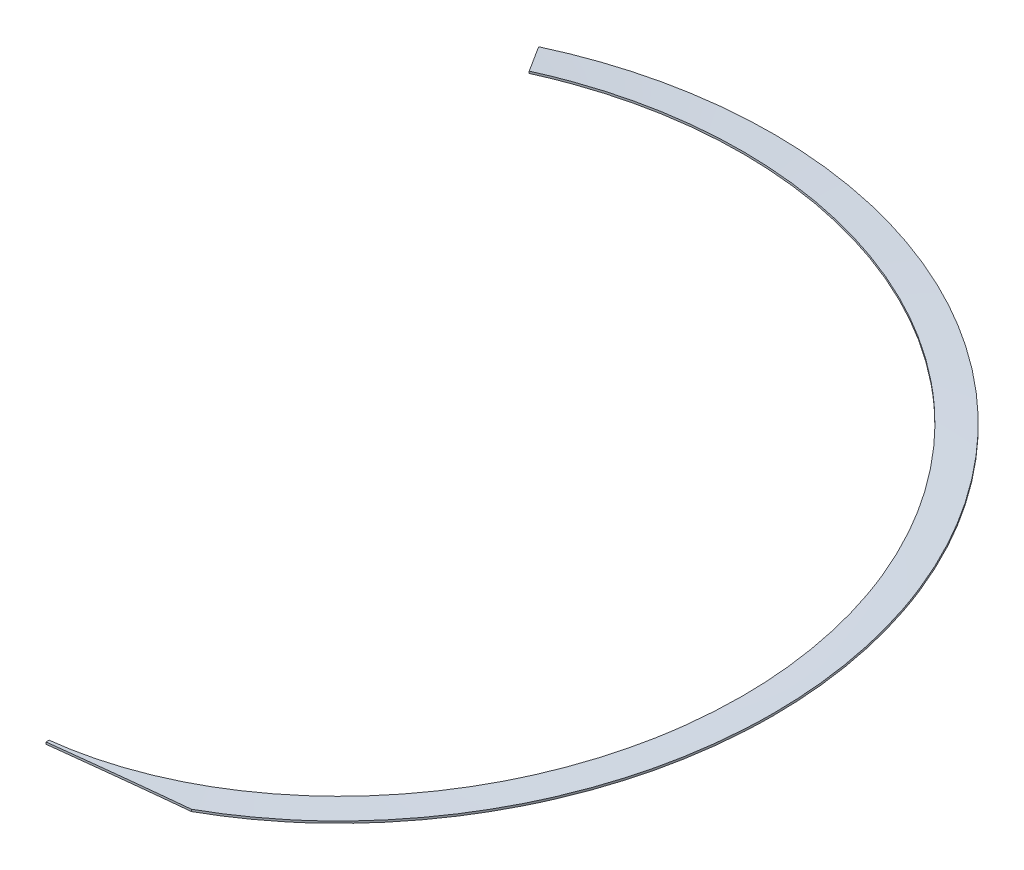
ISO-10303-21;
HEADER;
FILE_DESCRIPTION(('STEP AP214'),'2;1');
FILE_NAME('part.step','',(''),(''),'','','');
FILE_SCHEMA(('AUTOMOTIVE_DESIGN { 1 0 10303 214 1 1 1 1 }'));
ENDSEC;
DATA;
#1=APPLICATION_CONTEXT('core data for automotive mechanical design processes');
#2=APPLICATION_PROTOCOL_DEFINITION('international standard','automotive_design',2000,#1);
#3=PRODUCT_CONTEXT('',#1,'mechanical');
#4=PRODUCT('Part','Part','',(#3));
#5=PRODUCT_RELATED_PRODUCT_CATEGORY('part','',(#4));
#6=PRODUCT_DEFINITION_FORMATION('','',#4);
#7=PRODUCT_DEFINITION_CONTEXT('part definition',#1,'design');
#8=PRODUCT_DEFINITION('design','',#6,#7);
#9=PRODUCT_DEFINITION_SHAPE('','',#8);
#10=(LENGTH_UNIT() NAMED_UNIT(*) SI_UNIT(.MILLI.,.METRE.));
#11=(NAMED_UNIT(*) PLANE_ANGLE_UNIT() SI_UNIT($,.RADIAN.));
#12=(NAMED_UNIT(*) SI_UNIT($,.STERADIAN.) SOLID_ANGLE_UNIT());
#13=UNCERTAINTY_MEASURE_WITH_UNIT(LENGTH_MEASURE(1.E-05),#10,'distance_accuracy_value','');
#14=(GEOMETRIC_REPRESENTATION_CONTEXT(3) GLOBAL_UNCERTAINTY_ASSIGNED_CONTEXT((#13)) GLOBAL_UNIT_ASSIGNED_CONTEXT((#10,
#11,#12)) REPRESENTATION_CONTEXT('',''));
#15=CARTESIAN_POINT('',(0.,0.,0.));
#16=DIRECTION('',(0.,0.,1.));
#17=DIRECTION('',(1.,0.,0.));
#18=AXIS2_PLACEMENT_3D('',#15,#16,#17);
#19=CARTESIAN_POINT('',(0.,2.,390.));
#20=DIRECTION('',(-1.,0.,0.));
#21=DIRECTION('',(0.,0.,1.));
#22=AXIS2_PLACEMENT_3D('',#19,#20,#21);
#23=PLANE('',#22);
#24=DIRECTION('',(0.,0.,-1.));
#25=VECTOR('',#24,1.);
#26=CARTESIAN_POINT('',(0.,0.,390.));
#27=LINE('',#26,#25);
#28=CARTESIAN_POINT('',(0.,0.,363.));
#29=VERTEX_POINT('',#28);
#30=CARTESIAN_POINT('',(0.,0.,360.));
#31=VERTEX_POINT('',#30);
#32=EDGE_CURVE('E85',#29,#31,#27,.T.);
#33=ORIENTED_EDGE('',*,*,#32,.F.);
#34=DIRECTION('',(0.,-1.,0.));
#35=VECTOR('',#34,1.);
#36=CARTESIAN_POINT('',(0.,142.835564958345,363.));
#37=LINE('',#36,#35);
#38=CARTESIAN_POINT('',(0.,2.,363.));
#39=VERTEX_POINT('',#38);
#40=EDGE_CURVE('E49',#39,#29,#37,.T.);
#41=ORIENTED_EDGE('',*,*,#40,.F.);
#42=DIRECTION('',(0.,0.,1.));
#43=VECTOR('',#42,1.);
#44=CARTESIAN_POINT('',(0.,2.,390.));
#45=LINE('',#44,#43);
#46=CARTESIAN_POINT('',(0.,2.,360.));
#47=VERTEX_POINT('',#46);
#48=EDGE_CURVE('E78',#47,#39,#45,.T.);
#49=ORIENTED_EDGE('',*,*,#48,.F.);
#50=DIRECTION('',(0.,1.,0.));
#51=VECTOR('',#50,1.);
#52=CARTESIAN_POINT('',(0.,0.,360.));
#53=LINE('',#52,#51);
#54=EDGE_CURVE('E98',#31,#47,#53,.T.);
#55=ORIENTED_EDGE('',*,*,#54,.F.);
#56=EDGE_LOOP('',(#33,#41,#49,#55));
#57=FACE_BOUND('',#56,.T.);
#58=ADVANCED_FACE('F33',(#57),#23,.T.);
#59=CARTESIAN_POINT('',(0.,2.,360.));
#60=CARTESIAN_POINT('',(51.7601858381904,7.39291217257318,360.));
#61=CARTESIAN_POINT('',(101.423720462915,12.7858243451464,345.417470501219));
#62=CARTESIAN_POINT('',(151.087255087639,18.1787365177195,330.834941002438));
#63=CARTESIAN_POINT('',(194.630694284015,23.5716486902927,302.851271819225));
#64=CARTESIAN_POINT('',(238.174133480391,28.9645608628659,274.867602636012));
#65=CARTESIAN_POINT('',(272.069846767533,34.3574730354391,235.749864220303));
#66=CARTESIAN_POINT('',(305.965560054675,39.7503852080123,196.632125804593));
#67=CARTESIAN_POINT('',(327.467518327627,45.1432973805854,149.549404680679));
#68=CARTESIAN_POINT('',(348.969476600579,50.5362095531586,102.466683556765));
#69=CARTESIAN_POINT('',(356.335719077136,55.9291217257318,51.2333417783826));
#70=CARTESIAN_POINT('',(363.701961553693,61.322033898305,0.));
#71=CARTESIAN_POINT('',(356.335719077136,66.7149460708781,-51.2333417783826));
#72=CARTESIAN_POINT('',(348.969476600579,72.1078582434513,-102.466683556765));
#73=CARTESIAN_POINT('',(327.467518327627,77.5007704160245,-149.549404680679));
#74=CARTESIAN_POINT('',(305.965560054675,82.8936825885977,-196.632125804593));
#75=CARTESIAN_POINT('',(272.069846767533,88.2865947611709,-235.749864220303));
#76=CARTESIAN_POINT('',(238.174133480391,93.679506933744,-274.867602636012));
#77=CARTESIAN_POINT('',(194.630694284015,99.0724191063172,-302.851271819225));
#78=CARTESIAN_POINT('',(151.087255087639,104.46533127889,-330.834941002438));
#79=CARTESIAN_POINT('',(101.423720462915,109.858243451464,-345.417470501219));
#80=CARTESIAN_POINT('',(51.7601858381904,115.251155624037,-360.));
#81=CARTESIAN_POINT('',(0.,120.64406779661,-360.));
#82=CARTESIAN_POINT('',(-51.7601858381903,126.036979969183,-360.));
#83=CARTESIAN_POINT('',(-101.423720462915,131.429892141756,-345.417470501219));
#84=CARTESIAN_POINT('',(-151.087255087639,136.822804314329,-330.834941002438));
#85=CARTESIAN_POINT('',(-194.630694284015,142.215716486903,-302.851271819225));
#86=CARTESIAN_POINT('',(-238.174133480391,147.608628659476,-274.867602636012));
#87=CARTESIAN_POINT('',(-272.069846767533,153.001540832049,-235.749864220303));
#88=CARTESIAN_POINT('',(0.,2.,390.));
#89=CARTESIAN_POINT('',(56.0735346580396,7.39291217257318,390.));
#90=CARTESIAN_POINT('',(109.875697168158,12.7858243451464,374.202259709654));
#91=CARTESIAN_POINT('',(163.677859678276,18.1787365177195,358.404519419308));
#92=CARTESIAN_POINT('',(210.849918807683,23.5716486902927,328.088877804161));
#93=CARTESIAN_POINT('',(258.021977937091,28.9645608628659,297.773236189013));
#94=CARTESIAN_POINT('',(294.742333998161,34.3574730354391,255.395686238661));
#95=CARTESIAN_POINT('',(331.462690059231,39.7503852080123,213.018136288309));
#96=CARTESIAN_POINT('',(354.756478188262,45.1432973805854,162.011855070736));
#97=CARTESIAN_POINT('',(378.050266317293,50.5362095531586,111.005573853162));
#98=CARTESIAN_POINT('',(386.030362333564,55.9291217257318,55.5027869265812));
#99=CARTESIAN_POINT('',(394.010458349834,61.322033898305,0.));
#100=CARTESIAN_POINT('',(386.030362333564,66.7149460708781,-55.5027869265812));
#101=CARTESIAN_POINT('',(378.050266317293,72.1078582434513,-111.005573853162));
#102=CARTESIAN_POINT('',(354.756478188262,77.5007704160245,-162.011855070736));
#103=CARTESIAN_POINT('',(331.462690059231,82.8936825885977,-213.018136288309));
#104=CARTESIAN_POINT('',(294.742333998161,88.2865947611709,-255.395686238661));
#105=CARTESIAN_POINT('',(258.021977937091,93.679506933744,-297.773236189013));
#106=CARTESIAN_POINT('',(210.849918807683,99.0724191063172,-328.088877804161));
#107=CARTESIAN_POINT('',(163.677859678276,104.46533127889,-358.404519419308));
#108=CARTESIAN_POINT('',(109.875697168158,109.858243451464,-374.202259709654));
#109=CARTESIAN_POINT('',(56.0735346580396,115.251155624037,-390.));
#110=CARTESIAN_POINT('',(0.,120.64406779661,-390.));
#111=CARTESIAN_POINT('',(-56.0735346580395,126.036979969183,-390.));
#112=CARTESIAN_POINT('',(-109.875697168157,131.429892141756,-374.202259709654));
#113=CARTESIAN_POINT('',(-163.677859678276,136.822804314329,-358.404519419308));
#114=CARTESIAN_POINT('',(-210.849918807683,142.215716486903,-328.088877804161));
#115=CARTESIAN_POINT('',(-258.021977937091,147.608628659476,-297.773236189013));
#116=CARTESIAN_POINT('',(-294.742333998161,153.001540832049,-255.395686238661));
#117=(BOUNDED_SURFACE() B_SPLINE_SURFACE(1,2,((#59,#60,#61,#62,#63,#64,#65,#66,#67,#68,#69,#70,
#71,#72,#73,#74,#75,#76,#77,#78,#79,#80,#81,#82,#83,#84,#85,#86,#87),(#88,#89,#90,#91,#92,#93,
#94,#95,#96,#97,#98,#99,#100,#101,#102,#103,#104,#105,#106,#107,#108,#109,#110,#111,#112,#113,
#114,#115,#116)),.UNSPECIFIED.,.F.,.F.,.F.) B_SPLINE_SURFACE_WITH_KNOTS((2,2),(3,2,2,2,2,2,2,2,
2,2,2,2,2,2,3),(0.,1.),(0.,0.0714285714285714,0.142857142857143,0.214285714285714,
0.285714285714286,0.357142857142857,0.428571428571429,0.5,0.571428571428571,0.642857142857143,
0.714285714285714,0.785714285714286,0.857142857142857,0.928571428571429,1.),
.UNSPECIFIED.) GEOMETRIC_REPRESENTATION_ITEM() RATIONAL_B_SPLINE_SURFACE(((1.,0.989821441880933,
1.,0.989821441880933,1.,0.989821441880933,1.,0.989821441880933,1.,0.989821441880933,1.,
0.989821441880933,1.,0.989821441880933,1.,0.989821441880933,1.,0.989821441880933,1.,
0.989821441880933,1.,0.989821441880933,1.,0.989821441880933,1.,0.989821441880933,1.,
0.989821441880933,1.),(1.,0.989821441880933,1.,0.989821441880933,1.,0.989821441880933,1.,
0.989821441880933,1.,0.989821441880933,1.,0.989821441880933,1.,0.989821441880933,1.,
0.989821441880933,1.,0.989821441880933,1.,0.989821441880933,1.,0.989821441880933,1.,
0.989821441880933,1.,0.989821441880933,1.,0.989821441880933,1.))) REPRESENTATION_ITEM('') SURFACE());
#118=CARTESIAN_POINT('',(0.,2.,363.));
#119=CARTESIAN_POINT('',(3.34976168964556,2.34612837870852,363.));
#120=CARTESIAN_POINT('',(6.69945272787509,2.69293874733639,363.));
#121=CARTESIAN_POINT('',(13.3987780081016,3.38713223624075,363.));
#122=CARTESIAN_POINT('',(16.7484122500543,3.73451535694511,363.));
#123=CARTESIAN_POINT('',(23.4477044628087,4.42906270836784,363.));
#124=CARTESIAN_POINT('',(26.7973624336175,4.77622693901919,363.));
#125=CARTESIAN_POINT('',(33.4968065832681,5.46955608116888,363.));
#126=CARTESIAN_POINT('',(36.8465927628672,5.81572098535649,363.));
#127=CARTESIAN_POINT('',(43.5463464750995,6.50628311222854,363.));
#128=CARTESIAN_POINT('',(46.8963140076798,6.85068033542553,363.));
#129=CARTESIAN_POINT('',(53.5965057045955,7.53696665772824,363.));
#130=CARTESIAN_POINT('',(56.9467298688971,7.87885575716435,363.));
#131=CARTESIAN_POINT('',(63.7239997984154,8.567186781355,363.));
#132=CARTESIAN_POINT('',(67.1510531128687,8.91355443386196,363.));
#133=CARTESIAN_POINT('',(74.0055700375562,9.60220962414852,363.));
#134=CARTESIAN_POINT('',(77.4330336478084,9.94449716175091,363.));
#135=CARTESIAN_POINT('',(84.2884214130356,10.6243232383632,363.));
#136=CARTESIAN_POINT('',(87.7163455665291,10.9618617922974,363.));
#137=CARTESIAN_POINT('',(92.858623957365,11.4641524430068,363.));
#138=CARTESIAN_POINT('',(94.572782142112,11.6309131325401,363.));
#139=CARTESIAN_POINT('',(98.0012353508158,11.9630212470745,363.));
#140=CARTESIAN_POINT('',(99.7155303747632,12.1283686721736,363.));
#141=CARTESIAN_POINT('',(102.572839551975,12.4027294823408,363.));
#142=CARTESIAN_POINT('',(103.715814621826,12.5121499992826,363.));
#143=CARTESIAN_POINT('',(106.001831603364,12.7302906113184,363.));
#144=CARTESIAN_POINT('',(107.144873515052,12.8390107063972,363.));
#145=CARTESIAN_POINT('',(109.430995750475,13.056048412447,363.));
#146=CARTESIAN_POINT('',(110.574076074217,13.1643660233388,363.));
#147=CARTESIAN_POINT('',(112.860279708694,13.3805465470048,363.));
#148=CARTESIAN_POINT('',(114.003403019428,13.4884094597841,363.));
#149=CARTESIAN_POINT('',(117.432839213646,13.8112955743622,363.));
#150=CARTESIAN_POINT('',(119.719218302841,14.0256161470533,363.));
#151=CARTESIAN_POINT('',(124.292182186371,14.4522185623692,363.));
#152=CARTESIAN_POINT('',(126.578766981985,14.6645003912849,363.));
#153=CARTESIAN_POINT('',(131.152138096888,15.086875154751,363.));
#154=CARTESIAN_POINT('',(133.438924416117,15.2969680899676,363.));
#155=CARTESIAN_POINT('',(138.012708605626,15.7148284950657,363.));
#156=CARTESIAN_POINT('',(140.299706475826,15.9225959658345,363.));
#157=CARTESIAN_POINT('',(142.586815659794,16.1291324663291,363.));
#158=B_SPLINE_CURVE_WITH_KNOTS('',3,(#118,#119,#120,#121,#122,#123,#124,#125,#126,#127,#128,
#129,#130,#131,#132,#133,#134,#135,#136,#137,#138,#139,#140,#141,#142,#143,#144,#145,#146,#147,
#148,#149,#150,#151,#152,#153,#154,#155,#156,#157),.UNSPECIFIED.,.F.,.F.,(4,2,2,2,2,2,2,2,2,2,2,
2,2,2,2,2,2,2,2,4),(0.,10.1027901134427,20.2055877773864,30.3083885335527,40.411263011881,
50.5141345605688,60.6170047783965,70.9505396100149,81.2840748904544,91.6175776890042,
96.7843292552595,101.9510804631,105.395682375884,108.840284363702,112.284887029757,
115.729489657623,122.618695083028,129.507946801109,136.397196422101,143.286443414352),.UNSPECIFIED.);
#159=CARTESIAN_POINT('',(142.586815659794,16.1291324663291,363.));
#160=VERTEX_POINT('',#159);
#161=EDGE_CURVE('E93',#39,#160,#158,.T.);
#162=CARTESIAN_POINT('',(0.,2.,390.));
#163=CARTESIAN_POINT('',(56.0735346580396,7.39291217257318,390.));
#164=CARTESIAN_POINT('',(109.875697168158,12.7858243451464,374.202259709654));
#165=CARTESIAN_POINT('',(163.677859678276,18.1787365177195,358.404519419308));
#166=CARTESIAN_POINT('',(210.849918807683,23.5716486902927,328.088877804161));
#167=CARTESIAN_POINT('',(258.021977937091,28.9645608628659,297.773236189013));
#168=CARTESIAN_POINT('',(294.742333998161,34.3574730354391,255.395686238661));
#169=CARTESIAN_POINT('',(331.462690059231,39.7503852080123,213.018136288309));
#170=CARTESIAN_POINT('',(354.756478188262,45.1432973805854,162.011855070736));
#171=CARTESIAN_POINT('',(378.050266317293,50.5362095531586,111.005573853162));
#172=CARTESIAN_POINT('',(386.030362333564,55.9291217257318,55.5027869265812));
#173=CARTESIAN_POINT('',(394.010458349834,61.322033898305,0.));
#174=CARTESIAN_POINT('',(386.030362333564,66.7149460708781,-55.5027869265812));
#175=CARTESIAN_POINT('',(378.050266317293,72.1078582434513,-111.005573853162));
#176=CARTESIAN_POINT('',(354.756478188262,77.5007704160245,-162.011855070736));
#177=CARTESIAN_POINT('',(331.462690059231,82.8936825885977,-213.018136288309));
#178=CARTESIAN_POINT('',(294.742333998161,88.2865947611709,-255.395686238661));
#179=CARTESIAN_POINT('',(258.021977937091,93.679506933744,-297.773236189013));
#180=CARTESIAN_POINT('',(210.849918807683,99.0724191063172,-328.088877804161));
#181=CARTESIAN_POINT('',(163.677859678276,104.46533127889,-358.404519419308));
#182=CARTESIAN_POINT('',(109.875697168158,109.858243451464,-374.202259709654));
#183=CARTESIAN_POINT('',(56.0735346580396,115.251155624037,-390.));
#184=CARTESIAN_POINT('',(0.,120.64406779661,-390.));
#185=CARTESIAN_POINT('',(-56.0735346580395,126.036979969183,-390.));
#186=CARTESIAN_POINT('',(-109.875697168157,131.429892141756,-374.202259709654));
#187=CARTESIAN_POINT('',(-163.677859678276,136.822804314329,-358.404519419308));
#188=CARTESIAN_POINT('',(-210.849918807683,142.215716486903,-328.088877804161));
#189=CARTESIAN_POINT('',(-258.021977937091,147.608628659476,-297.773236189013));
#190=CARTESIAN_POINT('',(-294.742333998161,153.001540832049,-255.395686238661));
#191=(BOUNDED_CURVE() B_SPLINE_CURVE(2,(#162,#163,#164,#165,#166,#167,#168,#169,#170,#171,#172,
#173,#174,#175,#176,#177,#178,#179,#180,#181,#182,#183,#184,#185,#186,#187,#188,#189,#190),
.UNSPECIFIED.,.F.,.F.) B_SPLINE_CURVE_WITH_KNOTS((3,2,2,2,2,2,2,2,2,2,2,2,2,2,3),(0.,
0.0714285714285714,0.142857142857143,0.214285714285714,0.285714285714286,0.357142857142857,
0.428571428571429,0.5,0.571428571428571,0.642857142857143,0.714285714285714,0.785714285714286,
0.857142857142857,0.928571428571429,1.),
.UNSPECIFIED.) CURVE() GEOMETRIC_REPRESENTATION_ITEM() RATIONAL_B_SPLINE_CURVE((1.,
0.989821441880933,1.,0.989821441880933,1.,0.989821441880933,1.,0.989821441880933,1.,
0.989821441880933,1.,0.989821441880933,1.,0.989821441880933,1.,0.989821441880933,1.,
0.989821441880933,1.,0.989821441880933,1.,0.989821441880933,1.,0.989821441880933,1.,
0.989821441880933,1.,0.989821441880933,1.)) REPRESENTATION_ITEM(''));
#192=CARTESIAN_POINT('',(-208.972417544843,142.000689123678,-329.287911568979));
#193=VERTEX_POINT('',#192);
#194=EDGE_CURVE('E36',#160,#193,#191,.T.);
#195=DIRECTION('',(-0.535826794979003,0.,-0.844327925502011));
#196=VECTOR('',#195,1.);
#197=CARTESIAN_POINT('',(-208.972450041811,142.,-329.287890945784));
#198=LINE('',#197,#196);
#199=CARTESIAN_POINT('',(-192.897609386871,142.000646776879,-303.958076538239));
#200=VERTEX_POINT('',#199);
#201=EDGE_CURVE('E113',#200,#193,#198,.T.);
#202=CARTESIAN_POINT('',(0.,2.,360.));
#203=CARTESIAN_POINT('',(51.7601858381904,7.39291217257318,360.));
#204=CARTESIAN_POINT('',(101.423720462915,12.7858243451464,345.417470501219));
#205=CARTESIAN_POINT('',(151.087255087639,18.1787365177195,330.834941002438));
#206=CARTESIAN_POINT('',(194.630694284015,23.5716486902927,302.851271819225));
#207=CARTESIAN_POINT('',(238.174133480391,28.9645608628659,274.867602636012));
#208=CARTESIAN_POINT('',(272.069846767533,34.3574730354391,235.749864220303));
#209=CARTESIAN_POINT('',(305.965560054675,39.7503852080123,196.632125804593));
#210=CARTESIAN_POINT('',(327.467518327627,45.1432973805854,149.549404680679));
#211=CARTESIAN_POINT('',(348.969476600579,50.5362095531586,102.466683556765));
#212=CARTESIAN_POINT('',(356.335719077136,55.9291217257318,51.2333417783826));
#213=CARTESIAN_POINT('',(363.701961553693,61.322033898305,0.));
#214=CARTESIAN_POINT('',(356.335719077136,66.7149460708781,-51.2333417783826));
#215=CARTESIAN_POINT('',(348.969476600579,72.1078582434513,-102.466683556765));
#216=CARTESIAN_POINT('',(327.467518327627,77.5007704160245,-149.549404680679));
#217=CARTESIAN_POINT('',(305.965560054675,82.8936825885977,-196.632125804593));
#218=CARTESIAN_POINT('',(272.069846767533,88.2865947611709,-235.749864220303));
#219=CARTESIAN_POINT('',(238.174133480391,93.679506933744,-274.867602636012));
#220=CARTESIAN_POINT('',(194.630694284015,99.0724191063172,-302.851271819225));
#221=CARTESIAN_POINT('',(151.087255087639,104.46533127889,-330.834941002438));
#222=CARTESIAN_POINT('',(101.423720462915,109.858243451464,-345.417470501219));
#223=CARTESIAN_POINT('',(51.7601858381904,115.251155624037,-360.));
#224=CARTESIAN_POINT('',(0.,120.64406779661,-360.));
#225=CARTESIAN_POINT('',(-51.7601858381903,126.036979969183,-360.));
#226=CARTESIAN_POINT('',(-101.423720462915,131.429892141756,-345.417470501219));
#227=CARTESIAN_POINT('',(-151.087255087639,136.822804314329,-330.834941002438));
#228=CARTESIAN_POINT('',(-194.630694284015,142.215716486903,-302.851271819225));
#229=CARTESIAN_POINT('',(-238.174133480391,147.608628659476,-274.867602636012));
#230=CARTESIAN_POINT('',(-272.069846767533,153.001540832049,-235.749864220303));
#231=(BOUNDED_CURVE() B_SPLINE_CURVE(2,(#202,#203,#204,#205,#206,#207,#208,#209,#210,#211,#212,
#213,#214,#215,#216,#217,#218,#219,#220,#221,#222,#223,#224,#225,#226,#227,#228,#229,#230),
.UNSPECIFIED.,.F.,.F.) B_SPLINE_CURVE_WITH_KNOTS((3,2,2,2,2,2,2,2,2,2,2,2,2,2,3),(0.,
0.0714285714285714,0.142857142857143,0.214285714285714,0.285714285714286,0.357142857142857,
0.428571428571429,0.5,0.571428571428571,0.642857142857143,0.714285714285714,0.785714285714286,
0.857142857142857,0.928571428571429,1.),
.UNSPECIFIED.) CURVE() GEOMETRIC_REPRESENTATION_ITEM() RATIONAL_B_SPLINE_CURVE((1.,
0.989821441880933,1.,0.989821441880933,1.,0.989821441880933,1.,0.989821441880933,1.,
0.989821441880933,1.,0.989821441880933,1.,0.989821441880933,1.,0.989821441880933,1.,
0.989821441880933,1.,0.989821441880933,1.,0.989821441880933,1.,0.989821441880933,1.,
0.989821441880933,1.,0.989821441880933,1.)) REPRESENTATION_ITEM(''));
#232=EDGE_CURVE('E105',#47,#200,#231,.T.);
#233=ORIENTED_EDGE('',*,*,#48,.T.);
#234=ORIENTED_EDGE('',*,*,#161,.T.);
#235=ORIENTED_EDGE('',*,*,#194,.T.);
#236=ORIENTED_EDGE('',*,*,#201,.F.);
#237=ORIENTED_EDGE('',*,*,#232,.F.);
#238=EDGE_LOOP('',(#233,#234,#235,#236,#237));
#239=FACE_BOUND('',#238,.T.);
#240=ADVANCED_FACE('F102',(#239),#117,.T.);
#241=CARTESIAN_POINT('',(0.,0.,0.));
#242=DIRECTION('',(0.,1.,0.));
#243=DIRECTION('',(0.,0.,1.));
#244=AXIS2_PLACEMENT_3D('',#241,#242,#243);
#245=CYLINDRICAL_SURFACE('',#244,390.);
#246=ORIENTED_EDGE('',*,*,#194,.F.);
#247=DIRECTION('',(0.,1.,0.));
#248=VECTOR('',#247,1.);
#249=CARTESIAN_POINT('',(142.586815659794,0.,363.));
#250=LINE('',#249,#248);
#251=CARTESIAN_POINT('',(142.586815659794,14.1291324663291,363.));
#252=VERTEX_POINT('',#251);
#253=EDGE_CURVE('E95',#160,#252,#250,.F.);
#254=ORIENTED_EDGE('',*,*,#253,.T.);
#255=CARTESIAN_POINT('',(0.,0.,390.));
#256=CARTESIAN_POINT('',(56.0735346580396,5.39291217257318,390.));
#257=CARTESIAN_POINT('',(109.875697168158,10.7858243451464,374.202259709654));
#258=CARTESIAN_POINT('',(163.677859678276,16.1787365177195,358.404519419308));
#259=CARTESIAN_POINT('',(210.849918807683,21.5716486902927,328.088877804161));
#260=CARTESIAN_POINT('',(258.021977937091,26.9645608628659,297.773236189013));
#261=CARTESIAN_POINT('',(294.742333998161,32.3574730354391,255.395686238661));
#262=CARTESIAN_POINT('',(331.462690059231,37.7503852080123,213.018136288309));
#263=CARTESIAN_POINT('',(354.756478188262,43.1432973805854,162.011855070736));
#264=CARTESIAN_POINT('',(378.050266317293,48.5362095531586,111.005573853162));
#265=CARTESIAN_POINT('',(386.030362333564,53.9291217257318,55.5027869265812));
#266=CARTESIAN_POINT('',(394.010458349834,59.322033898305,0.));
#267=CARTESIAN_POINT('',(386.030362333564,64.7149460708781,-55.5027869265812));
#268=CARTESIAN_POINT('',(378.050266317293,70.1078582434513,-111.005573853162));
#269=CARTESIAN_POINT('',(354.756478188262,75.5007704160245,-162.011855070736));
#270=CARTESIAN_POINT('',(331.462690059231,80.8936825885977,-213.018136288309));
#271=CARTESIAN_POINT('',(294.742333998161,86.2865947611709,-255.395686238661));
#272=CARTESIAN_POINT('',(258.021977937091,91.679506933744,-297.773236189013));
#273=CARTESIAN_POINT('',(210.849918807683,97.0724191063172,-328.088877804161));
#274=CARTESIAN_POINT('',(163.677859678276,102.46533127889,-358.404519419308));
#275=CARTESIAN_POINT('',(109.875697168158,107.858243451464,-374.202259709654));
#276=CARTESIAN_POINT('',(56.0735346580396,113.251155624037,-390.));
#277=CARTESIAN_POINT('',(0.,118.64406779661,-390.));
#278=CARTESIAN_POINT('',(-56.0735346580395,124.036979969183,-390.));
#279=CARTESIAN_POINT('',(-109.875697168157,129.429892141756,-374.202259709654));
#280=CARTESIAN_POINT('',(-163.677859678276,134.822804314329,-358.404519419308));
#281=CARTESIAN_POINT('',(-210.849918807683,140.215716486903,-328.088877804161));
#282=CARTESIAN_POINT('',(-258.021977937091,145.608628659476,-297.773236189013));
#283=CARTESIAN_POINT('',(-294.742333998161,151.001540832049,-255.395686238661));
#284=(BOUNDED_CURVE() B_SPLINE_CURVE(2,(#255,#256,#257,#258,#259,#260,#261,#262,#263,#264,#265,
#266,#267,#268,#269,#270,#271,#272,#273,#274,#275,#276,#277,#278,#279,#280,#281,#282,#283),
.UNSPECIFIED.,.F.,.F.) B_SPLINE_CURVE_WITH_KNOTS((3,2,2,2,2,2,2,2,2,2,2,2,2,2,3),(0.,
0.0714285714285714,0.142857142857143,0.214285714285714,0.285714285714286,0.357142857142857,
0.428571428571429,0.5,0.571428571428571,0.642857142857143,0.714285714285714,0.785714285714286,
0.857142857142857,0.928571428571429,1.),
.UNSPECIFIED.) CURVE() GEOMETRIC_REPRESENTATION_ITEM() RATIONAL_B_SPLINE_CURVE((1.,
0.989821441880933,1.,0.989821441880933,1.,0.989821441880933,1.,0.989821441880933,1.,
0.989821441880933,1.,0.989821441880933,1.,0.989821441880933,1.,0.989821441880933,1.,
0.989821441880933,1.,0.989821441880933,1.,0.989821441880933,1.,0.989821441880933,1.,
0.989821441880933,1.,0.989821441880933,1.)) REPRESENTATION_ITEM(''));
#285=CARTESIAN_POINT('',(-208.9724120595,140.000647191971,-329.287915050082));
#286=VERTEX_POINT('',#285);
#287=EDGE_CURVE('E57',#252,#286,#284,.T.);
#288=ORIENTED_EDGE('',*,*,#287,.T.);
#289=DIRECTION('',(0.,-1.,0.));
#290=VECTOR('',#289,1.);
#291=CARTESIAN_POINT('',(-208.972450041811,140.,-329.287890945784));
#292=LINE('',#291,#290);
#293=EDGE_CURVE('E211',#193,#286,#292,.T.);
#294=ORIENTED_EDGE('',*,*,#293,.F.);
#295=EDGE_LOOP('',(#246,#254,#288,#294));
#296=FACE_BOUND('',#295,.T.);
#297=ADVANCED_FACE('F129',(#296),#245,.T.);
#298=CARTESIAN_POINT('',(0.,0.,390.));
#299=CARTESIAN_POINT('',(56.0735346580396,5.39291217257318,390.));
#300=CARTESIAN_POINT('',(109.875697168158,10.7858243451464,374.202259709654));
#301=CARTESIAN_POINT('',(163.677859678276,16.1787365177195,358.404519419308));
#302=CARTESIAN_POINT('',(210.849918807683,21.5716486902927,328.088877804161));
#303=CARTESIAN_POINT('',(258.021977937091,26.9645608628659,297.773236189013));
#304=CARTESIAN_POINT('',(294.742333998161,32.3574730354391,255.395686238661));
#305=CARTESIAN_POINT('',(331.462690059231,37.7503852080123,213.018136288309));
#306=CARTESIAN_POINT('',(354.756478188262,43.1432973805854,162.011855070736));
#307=CARTESIAN_POINT('',(378.050266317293,48.5362095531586,111.005573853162));
#308=CARTESIAN_POINT('',(386.030362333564,53.9291217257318,55.5027869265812));
#309=CARTESIAN_POINT('',(394.010458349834,59.322033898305,0.));
#310=CARTESIAN_POINT('',(386.030362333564,64.7149460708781,-55.5027869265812));
#311=CARTESIAN_POINT('',(378.050266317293,70.1078582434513,-111.005573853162));
#312=CARTESIAN_POINT('',(354.756478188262,75.5007704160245,-162.011855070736));
#313=CARTESIAN_POINT('',(331.462690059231,80.8936825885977,-213.018136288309));
#314=CARTESIAN_POINT('',(294.742333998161,86.2865947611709,-255.395686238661));
#315=CARTESIAN_POINT('',(258.021977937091,91.679506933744,-297.773236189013));
#316=CARTESIAN_POINT('',(210.849918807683,97.0724191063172,-328.088877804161));
#317=CARTESIAN_POINT('',(163.677859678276,102.46533127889,-358.404519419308));
#318=CARTESIAN_POINT('',(109.875697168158,107.858243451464,-374.202259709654));
#319=CARTESIAN_POINT('',(56.0735346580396,113.251155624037,-390.));
#320=CARTESIAN_POINT('',(0.,118.64406779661,-390.));
#321=CARTESIAN_POINT('',(-56.0735346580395,124.036979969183,-390.));
#322=CARTESIAN_POINT('',(-109.875697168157,129.429892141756,-374.202259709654));
#323=CARTESIAN_POINT('',(-163.677859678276,134.822804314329,-358.404519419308));
#324=CARTESIAN_POINT('',(-210.849918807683,140.215716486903,-328.088877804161));
#325=CARTESIAN_POINT('',(-258.021977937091,145.608628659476,-297.773236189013));
#326=CARTESIAN_POINT('',(-294.742333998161,151.001540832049,-255.395686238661));
#327=CARTESIAN_POINT('',(0.,0.,360.));
#328=CARTESIAN_POINT('',(51.7601858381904,5.39291217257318,360.));
#329=CARTESIAN_POINT('',(101.423720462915,10.7858243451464,345.417470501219));
#330=CARTESIAN_POINT('',(151.087255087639,16.1787365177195,330.834941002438));
#331=CARTESIAN_POINT('',(194.630694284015,21.5716486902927,302.851271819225));
#332=CARTESIAN_POINT('',(238.174133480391,26.9645608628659,274.867602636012));
#333=CARTESIAN_POINT('',(272.069846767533,32.3574730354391,235.749864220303));
#334=CARTESIAN_POINT('',(305.965560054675,37.7503852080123,196.632125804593));
#335=CARTESIAN_POINT('',(327.467518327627,43.1432973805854,149.549404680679));
#336=CARTESIAN_POINT('',(348.969476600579,48.5362095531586,102.466683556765));
#337=CARTESIAN_POINT('',(356.335719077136,53.9291217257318,51.2333417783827));
#338=CARTESIAN_POINT('',(363.701961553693,59.322033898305,0.));
#339=CARTESIAN_POINT('',(356.335719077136,64.7149460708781,-51.2333417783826));
#340=CARTESIAN_POINT('',(348.969476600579,70.1078582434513,-102.466683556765));
#341=CARTESIAN_POINT('',(327.467518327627,75.5007704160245,-149.549404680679));
#342=CARTESIAN_POINT('',(305.965560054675,80.8936825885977,-196.632125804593));
#343=CARTESIAN_POINT('',(272.069846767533,86.2865947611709,-235.749864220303));
#344=CARTESIAN_POINT('',(238.174133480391,91.679506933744,-274.867602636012));
#345=CARTESIAN_POINT('',(194.630694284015,97.0724191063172,-302.851271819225));
#346=CARTESIAN_POINT('',(151.087255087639,102.46533127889,-330.834941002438));
#347=CARTESIAN_POINT('',(101.423720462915,107.858243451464,-345.417470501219));
#348=CARTESIAN_POINT('',(51.7601858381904,113.251155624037,-360.));
#349=CARTESIAN_POINT('',(0.,118.64406779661,-360.));
#350=CARTESIAN_POINT('',(-51.7601858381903,124.036979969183,-360.));
#351=CARTESIAN_POINT('',(-101.423720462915,129.429892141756,-345.417470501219));
#352=CARTESIAN_POINT('',(-151.087255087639,134.822804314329,-330.834941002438));
#353=CARTESIAN_POINT('',(-194.630694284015,140.215716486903,-302.851271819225));
#354=CARTESIAN_POINT('',(-238.174133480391,145.608628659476,-274.867602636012));
#355=CARTESIAN_POINT('',(-272.069846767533,151.001540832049,-235.749864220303));
#356=(BOUNDED_SURFACE() B_SPLINE_SURFACE(1,2,((#298,#299,#300,#301,#302,#303,#304,#305,#306,
#307,#308,#309,#310,#311,#312,#313,#314,#315,#316,#317,#318,#319,#320,#321,#322,#323,#324,#325,
#326),(#327,#328,#329,#330,#331,#332,#333,#334,#335,#336,#337,#338,#339,#340,#341,#342,#343,
#344,#345,#346,#347,#348,#349,#350,#351,#352,#353,#354,#355)),.UNSPECIFIED.,.F.,.F.,
.F.) B_SPLINE_SURFACE_WITH_KNOTS((2,2),(3,2,2,2,2,2,2,2,2,2,2,2,2,2,3),(0.,1.),(0.,
0.0714285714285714,0.142857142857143,0.214285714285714,0.285714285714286,0.357142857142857,
0.428571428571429,0.5,0.571428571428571,0.642857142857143,0.714285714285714,0.785714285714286,
0.857142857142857,0.928571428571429,1.),
.UNSPECIFIED.) GEOMETRIC_REPRESENTATION_ITEM() RATIONAL_B_SPLINE_SURFACE(((1.,0.989821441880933,
1.,0.989821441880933,1.,0.989821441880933,1.,0.989821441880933,1.,0.989821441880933,1.,
0.989821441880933,1.,0.989821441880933,1.,0.989821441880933,1.,0.989821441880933,1.,
0.989821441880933,1.,0.989821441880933,1.,0.989821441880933,1.,0.989821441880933,1.,
0.989821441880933,1.),(1.,0.989821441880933,1.,0.989821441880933,1.,0.989821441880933,1.,
0.989821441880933,1.,0.989821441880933,1.,0.989821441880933,1.,0.989821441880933,1.,
0.989821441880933,1.,0.989821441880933,1.,0.989821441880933,1.,0.989821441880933,1.,
0.989821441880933,1.,0.989821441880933,1.,0.989821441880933,1.))) REPRESENTATION_ITEM('') SURFACE());
#357=CARTESIAN_POINT('',(142.586815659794,14.1291324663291,363.));
#358=CARTESIAN_POINT('',(140.071330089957,13.9019731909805,363.));
#359=CARTESIAN_POINT('',(137.555979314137,13.6733239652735,363.));
#360=CARTESIAN_POINT('',(132.525534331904,13.213228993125,363.));
#361=CARTESIAN_POINT('',(130.010440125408,12.9817832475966,363.));
#362=CARTESIAN_POINT('',(124.980503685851,12.5162793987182,363.));
#363=CARTESIAN_POINT('',(122.465661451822,12.2822213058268,363.));
#364=CARTESIAN_POINT('',(118.693567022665,11.9293263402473,363.));
#365=CARTESIAN_POINT('',(117.436230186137,11.8113933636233,363.));
#366=CARTESIAN_POINT('',(114.921610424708,11.5749533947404,363.));
#367=CARTESIAN_POINT('',(113.664327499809,11.4564464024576,363.));
#368=CARTESIAN_POINT('',(110.844914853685,11.190073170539,363.));
#369=CARTESIAN_POINT('',(109.282799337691,11.0420565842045,363.));
#370=CARTESIAN_POINT('',(106.939680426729,10.8194598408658,363.));
#371=CARTESIAN_POINT('',(106.158649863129,10.7451656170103,363.));
#372=CARTESIAN_POINT('',(104.596620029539,10.5962488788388,363.));
#373=CARTESIAN_POINT('',(103.81562075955,10.521626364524,363.));
#374=CARTESIAN_POINT('',(101.47266750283,10.2972956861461,363.));
#375=CARTESIAN_POINT('',(99.9107578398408,10.1471243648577,363.));
#376=CARTESIAN_POINT('',(96.787053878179,9.84558621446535,363.));
#377=CARTESIAN_POINT('',(95.2252595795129,9.69421938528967,363.));
#378=CARTESIAN_POINT('',(90.5400437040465,9.23840774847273,363.));
#379=CARTESIAN_POINT('',(87.4167884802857,8.93225172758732,363.));
#380=CARTESIAN_POINT('',(81.1706717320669,8.31582314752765,363.));
#381=CARTESIAN_POINT('',(78.0478102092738,8.00555057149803,363.));
#382=CARTESIAN_POINT('',(71.8024487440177,7.38137996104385,363.));
#383=CARTESIAN_POINT('',(68.6799488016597,7.06748192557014,363.));
#384=CARTESIAN_POINT('',(62.4352622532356,6.43658458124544,363.));
#385=CARTESIAN_POINT('',(59.313075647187,6.11958527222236,363.));
#386=CARTESIAN_POINT('',(53.0688692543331,5.48303200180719,363.));
#387=CARTESIAN_POINT('',(49.9468494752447,5.16347796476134,363.));
#388=CARTESIAN_POINT('',(43.7030119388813,4.52240810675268,363.));
#389=CARTESIAN_POINT('',(40.581194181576,4.20089228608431,363.));
#390=CARTESIAN_POINT('',(34.3376984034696,3.55650500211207,363.));
#391=CARTESIAN_POINT('',(31.2160203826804,3.23363353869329,363.));
#392=CARTESIAN_POINT('',(24.9727672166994,2.58716137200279,363.));
#393=CARTESIAN_POINT('',(21.851192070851,2.2635606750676,363.));
#394=CARTESIAN_POINT('',(15.6080520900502,1.61626254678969,363.));
#395=CARTESIAN_POINT('',(12.4864872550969,1.29256511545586,363.));
#396=CARTESIAN_POINT('',(6.24330206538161,0.645714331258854,363.));
#397=CARTESIAN_POINT('',(3.12168171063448,0.322560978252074,363.));
#398=CARTESIAN_POINT('',(0.,0.,363.));
#399=B_SPLINE_CURVE_WITH_KNOTS('',3,(#357,#358,#359,#360,#361,#362,#363,#364,#365,#366,#367,
#368,#369,#370,#371,#372,#373,#374,#375,#376,#377,#378,#379,#380,#381,#382,#383,#384,#385,#386,
#387,#388,#389,#390,#391,#392,#393,#394,#395,#396,#397,#398),.UNSPECIFIED.,.F.,.F.,(4,2,2,2,2,2,
2,2,2,2,2,2,2,2,2,2,2,2,2,2,4),(0.,7.57716362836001,15.154324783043,22.7314556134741,
26.5200221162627,30.3085887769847,35.0159258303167,37.3695942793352,39.7232627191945,
44.4305989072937,49.1379353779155,58.5526063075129,67.9673157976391,77.3820280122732,
86.7967407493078,96.2117333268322,105.626724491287,115.041716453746,124.456626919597,
133.871536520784,143.286443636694),.UNSPECIFIED.);
#400=EDGE_CURVE('E11',#252,#29,#399,.T.);
#401=CARTESIAN_POINT('',(0.,0.,360.));
#402=CARTESIAN_POINT('',(51.7601858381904,5.39291217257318,360.));
#403=CARTESIAN_POINT('',(101.423720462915,10.7858243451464,345.417470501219));
#404=CARTESIAN_POINT('',(151.087255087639,16.1787365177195,330.834941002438));
#405=CARTESIAN_POINT('',(194.630694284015,21.5716486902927,302.851271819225));
#406=CARTESIAN_POINT('',(238.174133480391,26.9645608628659,274.867602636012));
#407=CARTESIAN_POINT('',(272.069846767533,32.3574730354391,235.749864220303));
#408=CARTESIAN_POINT('',(305.965560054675,37.7503852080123,196.632125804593));
#409=CARTESIAN_POINT('',(327.467518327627,43.1432973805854,149.549404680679));
#410=CARTESIAN_POINT('',(348.969476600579,48.5362095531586,102.466683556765));
#411=CARTESIAN_POINT('',(356.335719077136,53.9291217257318,51.2333417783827));
#412=CARTESIAN_POINT('',(363.701961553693,59.322033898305,0.));
#413=CARTESIAN_POINT('',(356.335719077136,64.7149460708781,-51.2333417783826));
#414=CARTESIAN_POINT('',(348.969476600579,70.1078582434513,-102.466683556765));
#415=CARTESIAN_POINT('',(327.467518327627,75.5007704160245,-149.549404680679));
#416=CARTESIAN_POINT('',(305.965560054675,80.8936825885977,-196.632125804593));
#417=CARTESIAN_POINT('',(272.069846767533,86.2865947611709,-235.749864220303));
#418=CARTESIAN_POINT('',(238.174133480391,91.679506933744,-274.867602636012));
#419=CARTESIAN_POINT('',(194.630694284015,97.0724191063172,-302.851271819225));
#420=CARTESIAN_POINT('',(151.087255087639,102.46533127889,-330.834941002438));
#421=CARTESIAN_POINT('',(101.423720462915,107.858243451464,-345.417470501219));
#422=CARTESIAN_POINT('',(51.7601858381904,113.251155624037,-360.));
#423=CARTESIAN_POINT('',(0.,118.64406779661,-360.));
#424=CARTESIAN_POINT('',(-51.7601858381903,124.036979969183,-360.));
#425=CARTESIAN_POINT('',(-101.423720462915,129.429892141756,-345.417470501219));
#426=CARTESIAN_POINT('',(-151.087255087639,134.822804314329,-330.834941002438));
#427=CARTESIAN_POINT('',(-194.630694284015,140.215716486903,-302.851271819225));
#428=CARTESIAN_POINT('',(-238.174133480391,145.608628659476,-274.867602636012));
#429=CARTESIAN_POINT('',(-272.069846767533,151.001540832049,-235.749864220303));
#430=(BOUNDED_CURVE() B_SPLINE_CURVE(2,(#401,#402,#403,#404,#405,#406,#407,#408,#409,#410,#411,
#412,#413,#414,#415,#416,#417,#418,#419,#420,#421,#422,#423,#424,#425,#426,#427,#428,#429),
.UNSPECIFIED.,.F.,.F.) B_SPLINE_CURVE_WITH_KNOTS((3,2,2,2,2,2,2,2,2,2,2,2,2,2,3),(0.,
0.0714285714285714,0.142857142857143,0.214285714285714,0.285714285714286,0.357142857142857,
0.428571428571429,0.5,0.571428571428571,0.642857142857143,0.714285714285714,0.785714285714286,
0.857142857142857,0.928571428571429,1.),
.UNSPECIFIED.) CURVE() GEOMETRIC_REPRESENTATION_ITEM() RATIONAL_B_SPLINE_CURVE((1.,
0.989821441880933,1.,0.989821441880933,1.,0.989821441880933,1.,0.989821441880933,1.,
0.989821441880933,1.,0.989821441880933,1.,0.989821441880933,1.,0.989821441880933,1.,
0.989821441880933,1.,0.989821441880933,1.,0.989821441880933,1.,0.989821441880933,1.,
0.989821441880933,1.,0.989821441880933,1.)) REPRESENTATION_ITEM(''));
#431=CARTESIAN_POINT('',(-192.897614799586,140.000685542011,-303.958073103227));
#432=VERTEX_POINT('',#431);
#433=EDGE_CURVE('E107',#31,#432,#430,.T.);
#434=DIRECTION('',(0.535826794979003,0.,0.844327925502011));
#435=VECTOR('',#434,1.);
#436=CARTESIAN_POINT('',(-208.972450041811,140.,-329.287890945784));
#437=LINE('',#436,#435);
#438=EDGE_CURVE('E42',#286,#432,#437,.T.);
#439=ORIENTED_EDGE('',*,*,#287,.F.);
#440=ORIENTED_EDGE('',*,*,#400,.T.);
#441=ORIENTED_EDGE('',*,*,#32,.T.);
#442=ORIENTED_EDGE('',*,*,#433,.T.);
#443=ORIENTED_EDGE('',*,*,#438,.F.);
#444=EDGE_LOOP('',(#439,#440,#441,#442,#443));
#445=FACE_BOUND('',#444,.T.);
#446=ADVANCED_FACE('F156',(#445),#356,.T.);
#447=CARTESIAN_POINT('',(-208.972450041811,142.,-329.287890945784));
#448=DIRECTION('',(0.844327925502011,0.,-0.535826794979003));
#449=DIRECTION('',(-0.535826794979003,0.,-0.844327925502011));
#450=AXIS2_PLACEMENT_3D('',#447,#448,#449);
#451=PLANE('',#450);
#452=ORIENTED_EDGE('',*,*,#293,.T.);
#453=ORIENTED_EDGE('',*,*,#438,.T.);
#454=DIRECTION('',(0.,1.,0.));
#455=VECTOR('',#454,1.);
#456=CARTESIAN_POINT('',(-192.897646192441,140.,-303.958053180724));
#457=LINE('',#456,#455);
#458=EDGE_CURVE('E184',#432,#200,#457,.T.);
#459=ORIENTED_EDGE('',*,*,#458,.T.);
#460=ORIENTED_EDGE('',*,*,#201,.T.);
#461=EDGE_LOOP('',(#452,#453,#459,#460));
#462=FACE_BOUND('',#461,.T.);
#463=ADVANCED_FACE('F148',(#462),#451,.F.);
#464=CARTESIAN_POINT('',(0.,0.,0.));
#465=DIRECTION('',(0.,1.,0.));
#466=DIRECTION('',(0.,0.,1.));
#467=AXIS2_PLACEMENT_3D('',#464,#465,#466);
#468=CYLINDRICAL_SURFACE('',#467,360.);
#469=ORIENTED_EDGE('',*,*,#232,.T.);
#470=ORIENTED_EDGE('',*,*,#458,.F.);
#471=ORIENTED_EDGE('',*,*,#433,.F.);
#472=ORIENTED_EDGE('',*,*,#54,.T.);
#473=EDGE_LOOP('',(#469,#470,#471,#472));
#474=FACE_BOUND('',#473,.T.);
#475=ADVANCED_FACE('F130',(#474),#468,.F.);
#476=CARTESIAN_POINT('',(0.,142.835564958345,363.));
#477=DIRECTION('',(0.,0.,1.));
#478=DIRECTION('',(1.,0.,0.));
#479=AXIS2_PLACEMENT_3D('',#476,#477,#478);
#480=PLANE('',#479);
#481=ORIENTED_EDGE('',*,*,#40,.T.);
#482=ORIENTED_EDGE('',*,*,#400,.F.);
#483=ORIENTED_EDGE('',*,*,#253,.F.);
#484=ORIENTED_EDGE('',*,*,#161,.F.);
#485=EDGE_LOOP('',(#481,#482,#483,#484));
#486=FACE_BOUND('',#485,.T.);
#487=ADVANCED_FACE('F94',(#486),#480,.T.);
#488=CLOSED_SHELL('',(#58,#240,#297,#446,#463,#475,#487));
#489=MANIFOLD_SOLID_BREP('B2',#488);
#490=ADVANCED_BREP_SHAPE_REPRESENTATION('',(#18,#489),#14);
#491=SHAPE_DEFINITION_REPRESENTATION(#9,#490);
ENDSEC;
END-ISO-10303-21;
